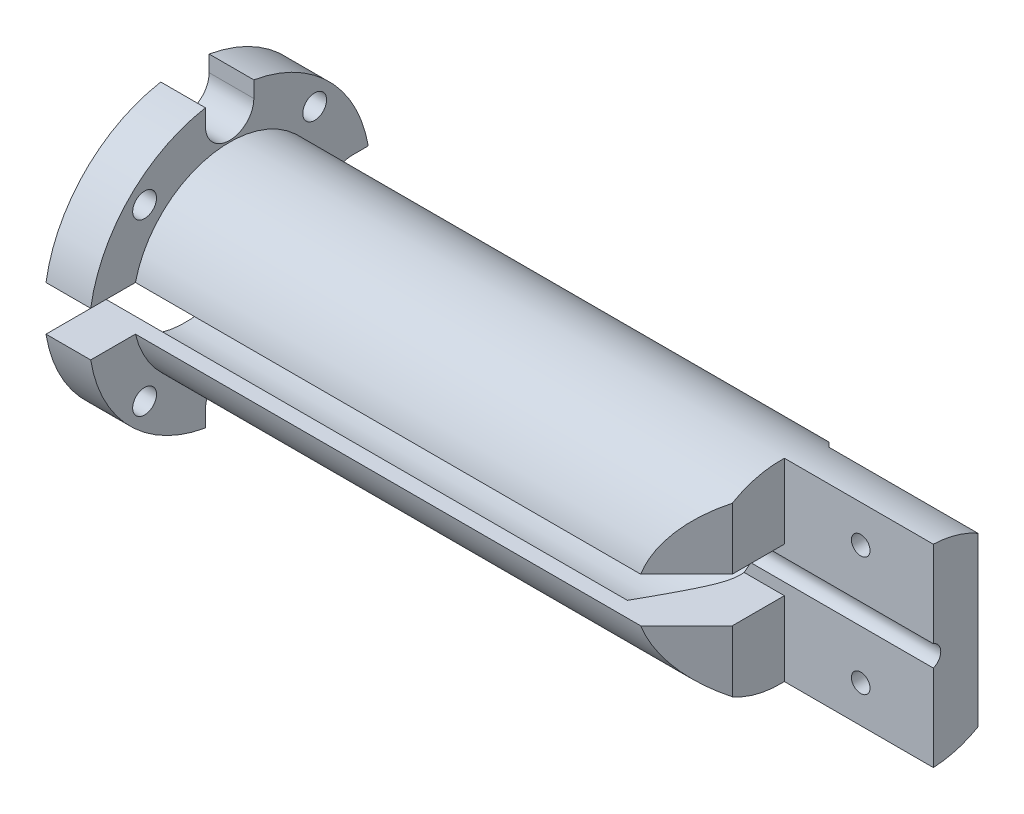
from build123d import *

# Parameters (mm, degrees)
LINEAR_AUSTRAGEN1_DEPTH          = 104.510482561
LINEAR_AUSTRAGEN2_DEPTH          = 104.510482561
SKIZZE4_W                        = 20
SKIZZE4_H                        = 26
LINEAR_AUSTRAGEN3_DEPTH          = 7
LINEAR_AUSTRAGEN4_REACH          = 105.51
KREISMUSTER1_COUNT               = 3
KREISMUSTER1_ANGLE               = 180
F_3_2_3_2_DURCHMESSER_BOHRUNG1_D = 3.2
KREISMUSTER2_COUNT               = 4
M3_GEWINDEBOHRUNG1_D             = 2.5


with BuildPart() as part:
    # Skizze1 → Rotation1 (revolve)
    with BuildSketch(Plane.XY, mode=Mode.PRIVATE) as rotation1_sk:
        Polygon((0, 11), (70, 11), (75.484827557, 1.5), (100, 1.5), (100, 13), (6, 13), (6, 18.9), (0, 18.9), align=None)
    revolve(rotation1_sk.sketch.rotate(Axis((0, 0, 0), (1, 0, 0)), 90), axis=Axis((0, 0, 0), (1, 0, 0)))

    # Skizze2 → Linear austragen1 (cut, through all)
    with BuildSketch(Plane.ZY):
        with BuildLine():
            Line((18.660385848, 3), (-0.5, 3))
            Line((-0.5, 3), (-0.5, -3))
            Line((-0.5, -3), (18.660385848, -3))
            ThreePointArc((18.660385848, -3), (18.9, 0), (18.660385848, 3))
        make_face()
    extrude(amount=-LINEAR_AUSTRAGEN1_DEPTH, mode=Mode.SUBTRACT)

    # Skizze3 → Linear austragen2 (cut, symmetric)
    with BuildSketch(Plane(origin=(0, 0, 0), x_dir=(1, 0, 0), z_dir=(0, 1, 0))):
        Polygon((100, 6.5), (80, 6.5), (73.5, 13), (100, 13), align=None)
    linear_austragen2 = extrude(amount=LINEAR_AUSTRAGEN2_DEPTH, both=True, mode=Mode.SUBTRACT)

    # Spiegeln1: Linear austragen2 across plane
    add(linear_austragen2.mirror(Plane.XY), mode=Mode.SUBTRACT)

    # Skizze4 → Linear austragen3 (cut)
    with BuildSketch(Plane.XY.offset(6.5)):
        with Locations((90, 0)):
            Rectangle(SKIZZE4_W, SKIZZE4_H)
    extrude(amount=-LINEAR_AUSTRAGEN3_DEPTH, mode=Mode.SUBTRACT)

    # Skizze5 → Linear austragen4 (cut, up to next)
    with BuildSketch(Plane.ZY, mode=Mode.PRIVATE) as linear_austragen4_sk1:
        with BuildLine():
            Line((-3.25, -16.45), (-3.25, -18.61847201))
            ThreePointArc((-3.25, -18.61847201), (0, -18.9), (3.25, -18.61847201))
            Line((3.25, -18.61847201), (3.25, -16.45))
            ThreePointArc((3.25, -16.45), (0, -13.2), (-3.25, -16.45))
        make_face()
    linear_austragen4_tool1 = extrude(linear_austragen4_sk1.sketch, amount=-LINEAR_AUSTRAGEN4_REACH, mode=Mode.PRIVATE) & part.part
    linear_austragen4 = linear_austragen4_tool1.solids().sort_by_distance((0, -16.299069, 0))[0]
    add(linear_austragen4, mode=Mode.SUBTRACT)

    # Kreismuster1: Linear austragen4 ×3 about axis
    kreismuster1_axis = Axis((0, 0, 0), (1, 0, 0))
    for i in range(1, KREISMUSTER1_COUNT):
        add(linear_austragen4.rotate(kreismuster1_axis, i * KREISMUSTER1_ANGLE / (KREISMUSTER1_COUNT - 1)), mode=Mode.SUBTRACT)

    # 3.2 _3.2_ Durchmesser Bohrung1 (through all)
    with Locations(Plane.ZY):
        with Locations((-11.419774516, 11.419774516)):
            f_3_2_3_2_durchmesser_bohrung1 = Hole(F_3_2_3_2_DURCHMESSER_BOHRUNG1_D / 2)

    # Kreismuster2: 3.2 _3.2_ Durchmesser Bohrung1 ×4 about axis
    kreismuster2_axis = Axis((0, 0, 0), (1, 0, 0))
    for i in range(1, KREISMUSTER2_COUNT):
        add(f_3_2_3_2_durchmesser_bohrung1.rotate(kreismuster2_axis, i * 360 / KREISMUSTER2_COUNT), mode=Mode.SUBTRACT)

    # M3 Gewindebohrung1 (through all)
    with Locations(Plane.XY.offset(-0.5)):
        with Locations((90.25, 8), (90.25, -8)):
            Hole(M3_GEWINDEBOHRUNG1_D / 2)


solid = part.part
